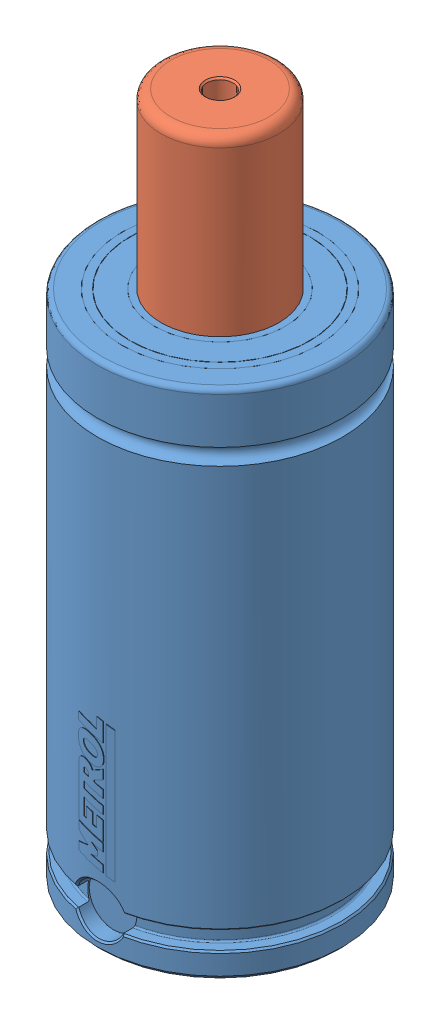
SolidWorks assembly ISNG1500-050.SLDASM, configuration Default (file format 7000). Lengths in mm.
Overall size (75 210 75.11).
2 component instances, 2 part files, 5 mates.
Components (placement in the parent):
- ISNG-1500 Body-1: ISNG-1500 Body.SLDPRT [ISNG-1500-50] x (0 0 1) z (0 -1 0) size (75.11 75 157)
- ISNG-1500 Piston-1: ISNG-1500 Piston.SLDPRT [ISNG-1500-50] at (0 132 0) x (-0.97589 0 0.218265) z (0 -1 0) size (50 50 78)
Mates (geometry in assembly coordinates):
- Coincident1: coincident aligned: circle of ISNG-1500 Body-1; cylinder of ISNG-1500 Piston-1 through (0 132 0) axis (0 -1 0) radius 18
- LimitDistance1: limit distance anti-aligned: plane of ISNG-1500 Body-1 through (-18 137 0) normal (0 -1 0); plane of ISNG-1500 Piston-1 through (-5.4566 137 -24.3972) normal (0 1 0)
- Coincident3: coincident anti-aligned: plane of ISNG-1500 Body-1 through (0 0 0) normal (0 -1 0); plane of assembly through (0 0 0) normal (0 1 0)
- Coincident4: coincident aligned: plane of ISNG-1500 Body-1; plane of assembly through (0 0 0) normal (0 0 1)
- Coincident5: coincident anti-aligned: plane of ISNG-1500 Body-1; plane of assembly through (0 0 0) normal (1 0 0)
